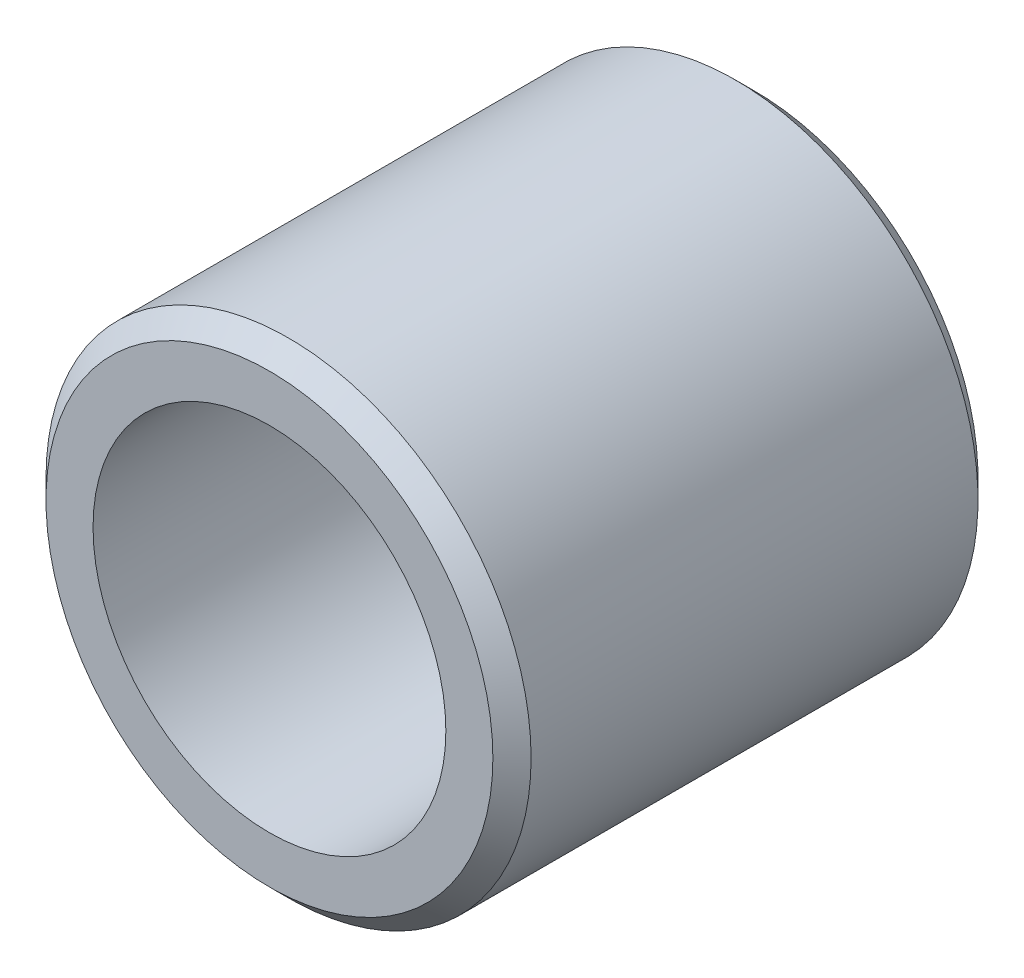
ISO-10303-21;
HEADER;
FILE_DESCRIPTION(('STEP AP214'),'2;1');
FILE_NAME('part.step','',(''),(''),'','','');
FILE_SCHEMA(('AUTOMOTIVE_DESIGN { 1 0 10303 214 1 1 1 1 }'));
ENDSEC;
DATA;
#1=APPLICATION_CONTEXT('core data for automotive mechanical design processes');
#2=APPLICATION_PROTOCOL_DEFINITION('international standard','automotive_design',2000,#1);
#3=PRODUCT_CONTEXT('',#1,'mechanical');
#4=PRODUCT('Part','Part','',(#3));
#5=PRODUCT_RELATED_PRODUCT_CATEGORY('part','',(#4));
#6=PRODUCT_DEFINITION_FORMATION('','',#4);
#7=PRODUCT_DEFINITION_CONTEXT('part definition',#1,'design');
#8=PRODUCT_DEFINITION('design','',#6,#7);
#9=PRODUCT_DEFINITION_SHAPE('','',#8);
#10=(LENGTH_UNIT() NAMED_UNIT(*) SI_UNIT(.MILLI.,.METRE.));
#11=(NAMED_UNIT(*) PLANE_ANGLE_UNIT() SI_UNIT($,.RADIAN.));
#12=(NAMED_UNIT(*) SI_UNIT($,.STERADIAN.) SOLID_ANGLE_UNIT());
#13=UNCERTAINTY_MEASURE_WITH_UNIT(LENGTH_MEASURE(1.E-05),#10,'distance_accuracy_value','');
#14=(GEOMETRIC_REPRESENTATION_CONTEXT(3) GLOBAL_UNCERTAINTY_ASSIGNED_CONTEXT((#13)) GLOBAL_UNIT_ASSIGNED_CONTEXT((#10,
#11,#12)) REPRESENTATION_CONTEXT('',''));
#15=CARTESIAN_POINT('',(0.,0.,0.));
#16=DIRECTION('',(0.,0.,1.));
#17=DIRECTION('',(1.,0.,0.));
#18=AXIS2_PLACEMENT_3D('',#15,#16,#17);
#19=CARTESIAN_POINT('',(0.,0.,0.));
#20=DIRECTION('',(0.,0.,-1.));
#21=DIRECTION('',(-1.,0.,0.));
#22=AXIS2_PLACEMENT_3D('',#19,#20,#21);
#23=CYLINDRICAL_SURFACE('',#22,12.);
#24=CARTESIAN_POINT('',(0.,0.,0.));
#25=DIRECTION('',(0.,0.,-1.));
#26=DIRECTION('',(-1.,0.,0.));
#27=AXIS2_PLACEMENT_3D('',#24,#25,#26);
#28=CIRCLE('',#27,12.);
#29=CARTESIAN_POINT('',(-12.,0.,0.));
#30=VERTEX_POINT('',#29);
#31=EDGE_CURVE('E34',#30,#30,#28,.T.);
#32=ORIENTED_EDGE('',*,*,#31,.T.);
#33=EDGE_LOOP('',(#32));
#34=FACE_BOUND('',#33,.T.);
#35=CARTESIAN_POINT('',(0.,0.,33.));
#36=DIRECTION('',(0.,0.,-1.));
#37=DIRECTION('',(-1.,0.,0.));
#38=AXIS2_PLACEMENT_3D('',#35,#36,#37);
#39=CIRCLE('',#38,12.);
#40=CARTESIAN_POINT('',(-12.,0.,33.));
#41=VERTEX_POINT('',#40);
#42=EDGE_CURVE('E31',#41,#41,#39,.T.);
#43=ORIENTED_EDGE('',*,*,#42,.F.);
#44=EDGE_LOOP('',(#43));
#45=FACE_BOUND('',#44,.T.);
#46=ADVANCED_FACE('F12',(#34,#45),#23,.F.);
#47=CARTESIAN_POINT('',(-12.,0.,33.));
#48=DIRECTION('',(0.,0.,1.));
#49=DIRECTION('',(1.,0.,0.));
#50=AXIS2_PLACEMENT_3D('',#47,#48,#49);
#51=PLANE('',#50);
#52=CARTESIAN_POINT('',(0.,0.,33.));
#53=DIRECTION('',(0.,0.,1.));
#54=DIRECTION('',(1.,0.,0.));
#55=AXIS2_PLACEMENT_3D('',#52,#53,#54);
#56=CIRCLE('',#55,15.2);
#57=CARTESIAN_POINT('',(15.2,0.,33.));
#58=VERTEX_POINT('',#57);
#59=EDGE_CURVE('E8',#58,#58,#56,.T.);
#60=ORIENTED_EDGE('',*,*,#59,.T.);
#61=EDGE_LOOP('',(#60));
#62=FACE_BOUND('',#61,.T.);
#63=ORIENTED_EDGE('',*,*,#42,.T.);
#64=EDGE_LOOP('',(#63));
#65=FACE_BOUND('',#64,.T.);
#66=ADVANCED_FACE('F55',(#62,#65),#51,.T.);
#67=CARTESIAN_POINT('',(0.,0.,0.));
#68=DIRECTION('',(0.,0.,-1.));
#69=DIRECTION('',(-1.,0.,0.));
#70=AXIS2_PLACEMENT_3D('',#67,#68,#69);
#71=CYLINDRICAL_SURFACE('',#70,16.5);
#72=CARTESIAN_POINT('',(0.,0.,1.3));
#73=DIRECTION('',(0.,0.,-1.));
#74=DIRECTION('',(-1.,0.,0.));
#75=AXIS2_PLACEMENT_3D('',#72,#73,#74);
#76=CIRCLE('',#75,16.5);
#77=CARTESIAN_POINT('',(-16.5,0.,1.3));
#78=VERTEX_POINT('',#77);
#79=EDGE_CURVE('E18',#78,#78,#76,.F.);
#80=ORIENTED_EDGE('',*,*,#79,.T.);
#81=EDGE_LOOP('',(#80));
#82=FACE_BOUND('',#81,.T.);
#83=CARTESIAN_POINT('',(0.,0.,31.7));
#84=DIRECTION('',(0.,0.,1.));
#85=DIRECTION('',(1.,0.,0.));
#86=AXIS2_PLACEMENT_3D('',#83,#84,#85);
#87=CIRCLE('',#86,16.5);
#88=CARTESIAN_POINT('',(16.5,0.,31.7));
#89=VERTEX_POINT('',#88);
#90=EDGE_CURVE('E22',#89,#89,#87,.F.);
#91=ORIENTED_EDGE('',*,*,#90,.T.);
#92=EDGE_LOOP('',(#91));
#93=FACE_BOUND('',#92,.T.);
#94=ADVANCED_FACE('F43',(#82,#93),#71,.T.);
#95=CARTESIAN_POINT('',(-12.,0.,0.));
#96=DIRECTION('',(0.,0.,-1.));
#97=DIRECTION('',(-1.,0.,0.));
#98=AXIS2_PLACEMENT_3D('',#95,#96,#97);
#99=PLANE('',#98);
#100=CARTESIAN_POINT('',(0.,0.,0.));
#101=DIRECTION('',(0.,0.,-1.));
#102=DIRECTION('',(-1.,0.,0.));
#103=AXIS2_PLACEMENT_3D('',#100,#101,#102);
#104=CIRCLE('',#103,15.2);
#105=CARTESIAN_POINT('',(-15.2,0.,0.));
#106=VERTEX_POINT('',#105);
#107=EDGE_CURVE('E26',#106,#106,#104,.T.);
#108=ORIENTED_EDGE('',*,*,#107,.T.);
#109=EDGE_LOOP('',(#108));
#110=FACE_BOUND('',#109,.T.);
#111=ORIENTED_EDGE('',*,*,#31,.F.);
#112=EDGE_LOOP('',(#111));
#113=FACE_BOUND('',#112,.T.);
#114=ADVANCED_FACE('F40',(#110,#113),#99,.T.);
#115=CARTESIAN_POINT('',(0.,0.,0.));
#116=DIRECTION('',(0.,0.,1.));
#117=DIRECTION('',(1.,0.,0.));
#118=AXIS2_PLACEMENT_3D('',#115,#116,#117);
#119=CONICAL_SURFACE('',#118,15.2,0.785398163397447);
#120=ORIENTED_EDGE('',*,*,#79,.F.);
#121=EDGE_LOOP('',(#120));
#122=FACE_BOUND('',#121,.T.);
#123=ORIENTED_EDGE('',*,*,#107,.F.);
#124=EDGE_LOOP('',(#123));
#125=FACE_BOUND('',#124,.T.);
#126=ADVANCED_FACE('F42',(#122,#125),#119,.T.);
#127=CARTESIAN_POINT('',(0.,0.,31.7));
#128=DIRECTION('',(0.,0.,-1.));
#129=DIRECTION('',(-1.,0.,0.));
#130=AXIS2_PLACEMENT_3D('',#127,#128,#129);
#131=CONICAL_SURFACE('',#130,16.5,0.78539816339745);
#132=ORIENTED_EDGE('',*,*,#59,.F.);
#133=EDGE_LOOP('',(#132));
#134=FACE_BOUND('',#133,.T.);
#135=ORIENTED_EDGE('',*,*,#90,.F.);
#136=EDGE_LOOP('',(#135));
#137=FACE_BOUND('',#136,.T.);
#138=ADVANCED_FACE('F52',(#134,#137),#131,.T.);
#139=CLOSED_SHELL('',(#46,#66,#94,#114,#126,#138));
#140=MANIFOLD_SOLID_BREP('B1',#139);
#141=ADVANCED_BREP_SHAPE_REPRESENTATION('',(#18,#140),#14);
#142=SHAPE_DEFINITION_REPRESENTATION(#9,#141);
ENDSEC;
END-ISO-10303-21;
